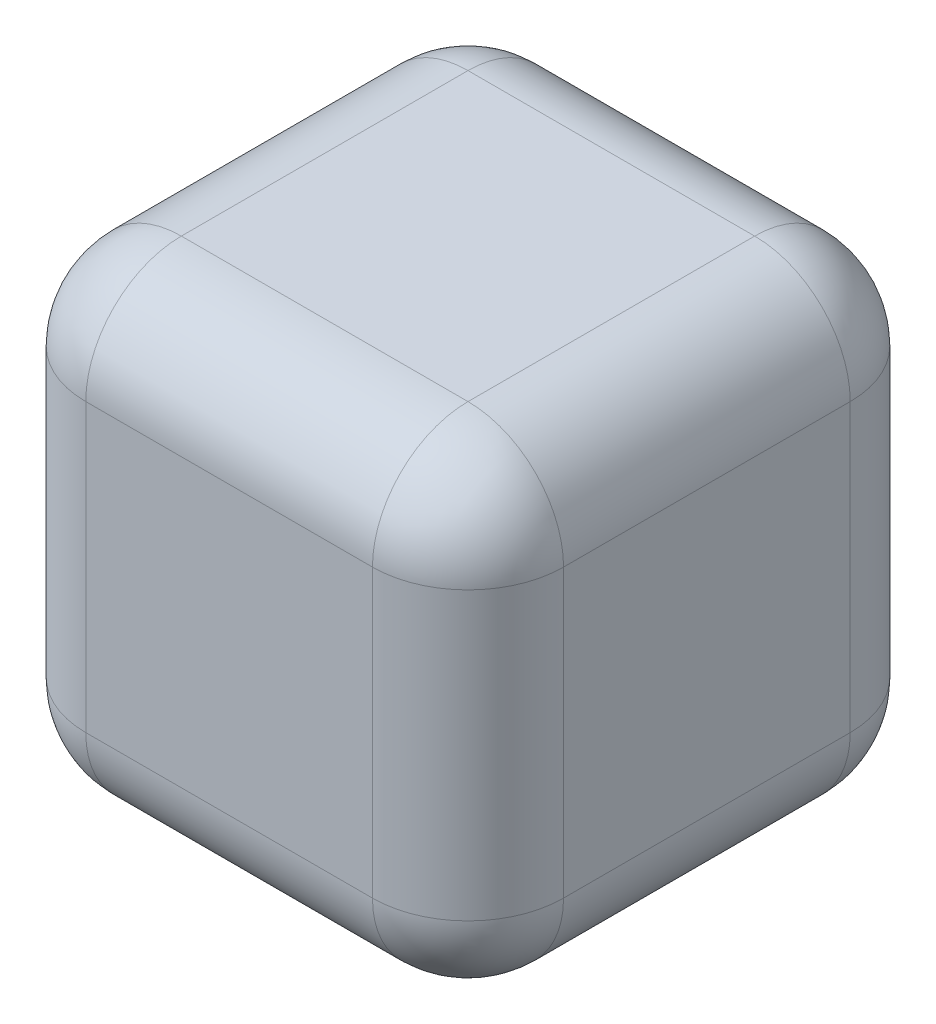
ISO-10303-21;
HEADER;
FILE_DESCRIPTION(('STEP AP214'),'2;1');
FILE_NAME('part.step','',(''),(''),'','','');
FILE_SCHEMA(('AUTOMOTIVE_DESIGN { 1 0 10303 214 1 1 1 1 }'));
ENDSEC;
DATA;
#1=APPLICATION_CONTEXT('core data for automotive mechanical design processes');
#2=APPLICATION_PROTOCOL_DEFINITION('international standard','automotive_design',2000,#1);
#3=PRODUCT_CONTEXT('',#1,'mechanical');
#4=PRODUCT('Part','Part','',(#3));
#5=PRODUCT_RELATED_PRODUCT_CATEGORY('part','',(#4));
#6=PRODUCT_DEFINITION_FORMATION('','',#4);
#7=PRODUCT_DEFINITION_CONTEXT('part definition',#1,'design');
#8=PRODUCT_DEFINITION('design','',#6,#7);
#9=PRODUCT_DEFINITION_SHAPE('','',#8);
#10=(LENGTH_UNIT() NAMED_UNIT(*) SI_UNIT(.MILLI.,.METRE.));
#11=(NAMED_UNIT(*) PLANE_ANGLE_UNIT() SI_UNIT($,.RADIAN.));
#12=(NAMED_UNIT(*) SI_UNIT($,.STERADIAN.) SOLID_ANGLE_UNIT());
#13=UNCERTAINTY_MEASURE_WITH_UNIT(LENGTH_MEASURE(1.E-05),#10,'distance_accuracy_value','');
#14=(GEOMETRIC_REPRESENTATION_CONTEXT(3) GLOBAL_UNCERTAINTY_ASSIGNED_CONTEXT((#13)) GLOBAL_UNIT_ASSIGNED_CONTEXT((#10,
#11,#12)) REPRESENTATION_CONTEXT('',''));
#15=CARTESIAN_POINT('',(0.,0.,0.));
#16=DIRECTION('',(0.,0.,1.));
#17=DIRECTION('',(1.,0.,0.));
#18=AXIS2_PLACEMENT_3D('',#15,#16,#17);
#19=CARTESIAN_POINT('',(0.,0.,10.));
#20=DIRECTION('',(1.,0.,0.));
#21=DIRECTION('',(0.,0.,-1.));
#22=AXIS2_PLACEMENT_3D('',#19,#20,#21);
#23=PLANE('',#22);
#24=DIRECTION('',(0.,-1.,0.));
#25=VECTOR('',#24,1.);
#26=CARTESIAN_POINT('',(0.,0.,8.));
#27=LINE('',#26,#25);
#28=CARTESIAN_POINT('',(0.,2.,8.));
#29=VERTEX_POINT('',#28);
#30=CARTESIAN_POINT('',(0.,8.,8.));
#31=VERTEX_POINT('',#30);
#32=EDGE_CURVE('E152',#29,#31,#27,.F.);
#33=ORIENTED_EDGE('',*,*,#32,.T.);
#34=DIRECTION('',(0.,0.,-1.));
#35=VECTOR('',#34,1.);
#36=CARTESIAN_POINT('',(0.,8.,10.));
#37=LINE('',#36,#35);
#38=CARTESIAN_POINT('',(0.,8.,2.));
#39=VERTEX_POINT('',#38);
#40=EDGE_CURVE('E155',#31,#39,#37,.T.);
#41=ORIENTED_EDGE('',*,*,#40,.T.);
#42=DIRECTION('',(0.,-1.,0.));
#43=VECTOR('',#42,1.);
#44=CARTESIAN_POINT('',(0.,0.,2.));
#45=LINE('',#44,#43);
#46=CARTESIAN_POINT('',(0.,2.,2.));
#47=VERTEX_POINT('',#46);
#48=EDGE_CURVE('E129',#39,#47,#45,.T.);
#49=ORIENTED_EDGE('',*,*,#48,.T.);
#50=DIRECTION('',(0.,0.,-1.));
#51=VECTOR('',#50,1.);
#52=CARTESIAN_POINT('',(0.,2.,10.));
#53=LINE('',#52,#51);
#54=EDGE_CURVE('E147',#47,#29,#53,.F.);
#55=ORIENTED_EDGE('',*,*,#54,.T.);
#56=EDGE_LOOP('',(#33,#41,#49,#55));
#57=FACE_BOUND('',#56,.T.);
#58=ADVANCED_FACE('F32',(#57),#23,.F.);
#59=CARTESIAN_POINT('',(0.,0.,10.));
#60=DIRECTION('',(0.,1.,0.));
#61=DIRECTION('',(0.,0.,1.));
#62=AXIS2_PLACEMENT_3D('',#59,#60,#61);
#63=PLANE('',#62);
#64=DIRECTION('',(1.,0.,0.));
#65=VECTOR('',#64,1.);
#66=CARTESIAN_POINT('',(10.,0.,2.));
#67=LINE('',#66,#65);
#68=CARTESIAN_POINT('',(2.,0.,2.));
#69=VERTEX_POINT('',#68);
#70=CARTESIAN_POINT('',(8.,0.,2.));
#71=VERTEX_POINT('',#70);
#72=EDGE_CURVE('E172',#69,#71,#67,.T.);
#73=ORIENTED_EDGE('',*,*,#72,.T.);
#74=DIRECTION('',(0.,0.,-1.));
#75=VECTOR('',#74,1.);
#76=CARTESIAN_POINT('',(8.,0.,10.));
#77=LINE('',#76,#75);
#78=CARTESIAN_POINT('',(8.,0.,8.));
#79=VERTEX_POINT('',#78);
#80=EDGE_CURVE('E175',#71,#79,#77,.F.);
#81=ORIENTED_EDGE('',*,*,#80,.T.);
#82=DIRECTION('',(1.,0.,0.));
#83=VECTOR('',#82,1.);
#84=CARTESIAN_POINT('',(0.,0.,8.));
#85=LINE('',#84,#83);
#86=CARTESIAN_POINT('',(2.,0.,8.));
#87=VERTEX_POINT('',#86);
#88=EDGE_CURVE('E170',#79,#87,#85,.F.);
#89=ORIENTED_EDGE('',*,*,#88,.T.);
#90=DIRECTION('',(0.,0.,-1.));
#91=VECTOR('',#90,1.);
#92=CARTESIAN_POINT('',(2.,0.,10.));
#93=LINE('',#92,#91);
#94=EDGE_CURVE('E168',#87,#69,#93,.T.);
#95=ORIENTED_EDGE('',*,*,#94,.T.);
#96=EDGE_LOOP('',(#73,#81,#89,#95));
#97=FACE_BOUND('',#96,.T.);
#98=ADVANCED_FACE('F322',(#97),#63,.F.);
#99=CARTESIAN_POINT('',(10.,0.,10.));
#100=DIRECTION('',(-1.,0.,0.));
#101=DIRECTION('',(0.,0.,1.));
#102=AXIS2_PLACEMENT_3D('',#99,#100,#101);
#103=PLANE('',#102);
#104=DIRECTION('',(0.,1.,0.));
#105=VECTOR('',#104,1.);
#106=CARTESIAN_POINT('',(10.,0.,8.));
#107=LINE('',#106,#105);
#108=CARTESIAN_POINT('',(10.,8.,8.));
#109=VERTEX_POINT('',#108);
#110=CARTESIAN_POINT('',(10.,2.,8.));
#111=VERTEX_POINT('',#110);
#112=EDGE_CURVE('E179',#109,#111,#107,.F.);
#113=ORIENTED_EDGE('',*,*,#112,.T.);
#114=DIRECTION('',(0.,0.,-1.));
#115=VECTOR('',#114,1.);
#116=CARTESIAN_POINT('',(10.,2.,10.));
#117=LINE('',#116,#115);
#118=CARTESIAN_POINT('',(10.,2.,2.));
#119=VERTEX_POINT('',#118);
#120=EDGE_CURVE('E184',#111,#119,#117,.T.);
#121=ORIENTED_EDGE('',*,*,#120,.T.);
#122=DIRECTION('',(0.,1.,0.));
#123=VECTOR('',#122,1.);
#124=CARTESIAN_POINT('',(10.,10.,2.));
#125=LINE('',#124,#123);
#126=CARTESIAN_POINT('',(10.,8.,2.));
#127=VERTEX_POINT('',#126);
#128=EDGE_CURVE('E181',#119,#127,#125,.T.);
#129=ORIENTED_EDGE('',*,*,#128,.T.);
#130=DIRECTION('',(0.,0.,-1.));
#131=VECTOR('',#130,1.);
#132=CARTESIAN_POINT('',(10.,8.,10.));
#133=LINE('',#132,#131);
#134=EDGE_CURVE('E177',#127,#109,#133,.F.);
#135=ORIENTED_EDGE('',*,*,#134,.T.);
#136=EDGE_LOOP('',(#113,#121,#129,#135));
#137=FACE_BOUND('',#136,.T.);
#138=ADVANCED_FACE('F292',(#137),#103,.F.);
#139=CARTESIAN_POINT('',(0.,10.,10.));
#140=DIRECTION('',(0.,-1.,0.));
#141=DIRECTION('',(0.,0.,-1.));
#142=AXIS2_PLACEMENT_3D('',#139,#140,#141);
#143=PLANE('',#142);
#144=DIRECTION('',(-1.,0.,0.));
#145=VECTOR('',#144,1.);
#146=CARTESIAN_POINT('',(0.,10.,2.));
#147=LINE('',#146,#145);
#148=CARTESIAN_POINT('',(8.,10.,2.));
#149=VERTEX_POINT('',#148);
#150=CARTESIAN_POINT('',(2.,10.,2.));
#151=VERTEX_POINT('',#150);
#152=EDGE_CURVE('E190',#149,#151,#147,.T.);
#153=ORIENTED_EDGE('',*,*,#152,.T.);
#154=DIRECTION('',(0.,0.,-1.));
#155=VECTOR('',#154,1.);
#156=CARTESIAN_POINT('',(2.,10.,10.));
#157=LINE('',#156,#155);
#158=CARTESIAN_POINT('',(2.,10.,8.));
#159=VERTEX_POINT('',#158);
#160=EDGE_CURVE('E193',#151,#159,#157,.F.);
#161=ORIENTED_EDGE('',*,*,#160,.T.);
#162=DIRECTION('',(-1.,0.,0.));
#163=VECTOR('',#162,1.);
#164=CARTESIAN_POINT('',(0.,10.,8.));
#165=LINE('',#164,#163);
#166=CARTESIAN_POINT('',(8.,10.,8.));
#167=VERTEX_POINT('',#166);
#168=EDGE_CURVE('E188',#159,#167,#165,.F.);
#169=ORIENTED_EDGE('',*,*,#168,.T.);
#170=DIRECTION('',(0.,0.,-1.));
#171=VECTOR('',#170,1.);
#172=CARTESIAN_POINT('',(8.,10.,10.));
#173=LINE('',#172,#171);
#174=EDGE_CURVE('E186',#167,#149,#173,.T.);
#175=ORIENTED_EDGE('',*,*,#174,.T.);
#176=EDGE_LOOP('',(#153,#161,#169,#175));
#177=FACE_BOUND('',#176,.T.);
#178=ADVANCED_FACE('F268',(#177),#143,.F.);
#179=CARTESIAN_POINT('',(0.,0.,10.));
#180=DIRECTION('',(0.,0.,-1.));
#181=DIRECTION('',(-1.,0.,0.));
#182=AXIS2_PLACEMENT_3D('',#179,#180,#181);
#183=PLANE('',#182);
#184=DIRECTION('',(-1.,0.,0.));
#185=VECTOR('',#184,1.);
#186=CARTESIAN_POINT('',(0.,8.,10.));
#187=LINE('',#186,#185);
#188=CARTESIAN_POINT('',(8.,8.,10.));
#189=VERTEX_POINT('',#188);
#190=CARTESIAN_POINT('',(2.,8.,10.));
#191=VERTEX_POINT('',#190);
#192=EDGE_CURVE('E195',#189,#191,#187,.T.);
#193=ORIENTED_EDGE('',*,*,#192,.T.);
#194=DIRECTION('',(0.,-1.,0.));
#195=VECTOR('',#194,1.);
#196=CARTESIAN_POINT('',(2.,0.,10.));
#197=LINE('',#196,#195);
#198=CARTESIAN_POINT('',(2.,2.,10.));
#199=VERTEX_POINT('',#198);
#200=EDGE_CURVE('E11',#191,#199,#197,.T.);
#201=ORIENTED_EDGE('',*,*,#200,.T.);
#202=DIRECTION('',(1.,0.,0.));
#203=VECTOR('',#202,1.);
#204=CARTESIAN_POINT('',(0.,2.,10.));
#205=LINE('',#204,#203);
#206=CARTESIAN_POINT('',(8.,2.,10.));
#207=VERTEX_POINT('',#206);
#208=EDGE_CURVE('E41',#199,#207,#205,.T.);
#209=ORIENTED_EDGE('',*,*,#208,.T.);
#210=DIRECTION('',(0.,1.,0.));
#211=VECTOR('',#210,1.);
#212=CARTESIAN_POINT('',(8.,0.,10.));
#213=LINE('',#212,#211);
#214=EDGE_CURVE('E197',#207,#189,#213,.T.);
#215=ORIENTED_EDGE('',*,*,#214,.T.);
#216=EDGE_LOOP('',(#193,#201,#209,#215));
#217=FACE_BOUND('',#216,.T.);
#218=ADVANCED_FACE('F276',(#217),#183,.F.);
#219=CARTESIAN_POINT('',(0.,0.,0.));
#220=DIRECTION('',(0.,0.,-1.));
#221=DIRECTION('',(-1.,0.,0.));
#222=AXIS2_PLACEMENT_3D('',#219,#220,#221);
#223=PLANE('',#222);
#224=DIRECTION('',(1.,0.,0.));
#225=VECTOR('',#224,1.);
#226=CARTESIAN_POINT('',(0.,2.,0.));
#227=LINE('',#226,#225);
#228=CARTESIAN_POINT('',(8.,2.,0.));
#229=VERTEX_POINT('',#228);
#230=CARTESIAN_POINT('',(2.,2.,0.));
#231=VERTEX_POINT('',#230);
#232=EDGE_CURVE('E165',#229,#231,#227,.F.);
#233=ORIENTED_EDGE('',*,*,#232,.T.);
#234=DIRECTION('',(0.,-1.,0.));
#235=VECTOR('',#234,1.);
#236=CARTESIAN_POINT('',(2.,10.,0.));
#237=LINE('',#236,#235);
#238=CARTESIAN_POINT('',(2.,8.,0.));
#239=VERTEX_POINT('',#238);
#240=EDGE_CURVE('E131',#231,#239,#237,.F.);
#241=ORIENTED_EDGE('',*,*,#240,.T.);
#242=DIRECTION('',(-1.,0.,0.));
#243=VECTOR('',#242,1.);
#244=CARTESIAN_POINT('',(10.,8.,0.));
#245=LINE('',#244,#243);
#246=CARTESIAN_POINT('',(8.,8.,0.));
#247=VERTEX_POINT('',#246);
#248=EDGE_CURVE('E158',#239,#247,#245,.F.);
#249=ORIENTED_EDGE('',*,*,#248,.T.);
#250=DIRECTION('',(0.,1.,0.));
#251=VECTOR('',#250,1.);
#252=CARTESIAN_POINT('',(8.,0.,0.));
#253=LINE('',#252,#251);
#254=EDGE_CURVE('E163',#247,#229,#253,.F.);
#255=ORIENTED_EDGE('',*,*,#254,.T.);
#256=EDGE_LOOP('',(#233,#241,#249,#255));
#257=FACE_BOUND('',#256,.T.);
#258=ADVANCED_FACE('F355',(#257),#223,.T.);
#259=CARTESIAN_POINT('',(8.,0.,8.));
#260=DIRECTION('',(0.,1.,0.));
#261=DIRECTION('',(0.,0.,1.));
#262=AXIS2_PLACEMENT_3D('',#259,#260,#261);
#263=CYLINDRICAL_SURFACE('',#262,2.);
#264=CARTESIAN_POINT('',(8.,8.,8.));
#265=DIRECTION('',(0.,1.,0.));
#266=DIRECTION('',(0.,0.,1.));
#267=AXIS2_PLACEMENT_3D('',#264,#265,#266);
#268=CIRCLE('',#267,2.);
#269=EDGE_CURVE('E36',#189,#109,#268,.T.);
#270=ORIENTED_EDGE('',*,*,#269,.F.);
#271=ORIENTED_EDGE('',*,*,#214,.F.);
#272=CARTESIAN_POINT('',(8.,2.,8.));
#273=DIRECTION('',(0.,-1.,0.));
#274=DIRECTION('',(0.,0.,-1.));
#275=AXIS2_PLACEMENT_3D('',#272,#273,#274);
#276=CIRCLE('',#275,2.);
#277=EDGE_CURVE('E246',#111,#207,#276,.T.);
#278=ORIENTED_EDGE('',*,*,#277,.F.);
#279=ORIENTED_EDGE('',*,*,#112,.F.);
#280=EDGE_LOOP('',(#270,#271,#278,#279));
#281=FACE_BOUND('',#280,.T.);
#282=ADVANCED_FACE('F34',(#281),#263,.T.);
#283=CARTESIAN_POINT('',(8.,8.,8.));
#284=DIRECTION('',(1.,0.,0.));
#285=DIRECTION('',(0.,0.,-1.));
#286=AXIS2_PLACEMENT_3D('',#283,#284,#285);
#287=SPHERICAL_SURFACE('',#286,2.);
#288=CARTESIAN_POINT('',(8.,8.,8.));
#289=DIRECTION('',(1.,0.,0.));
#290=DIRECTION('',(0.,0.,-1.));
#291=AXIS2_PLACEMENT_3D('',#288,#289,#290);
#292=CIRCLE('',#291,2.);
#293=EDGE_CURVE('E241',#189,#167,#292,.F.);
#294=ORIENTED_EDGE('',*,*,#293,.F.);
#295=ORIENTED_EDGE('',*,*,#269,.T.);
#296=CARTESIAN_POINT('',(8.,8.,8.));
#297=DIRECTION('',(0.,0.,1.));
#298=DIRECTION('',(1.,0.,0.));
#299=AXIS2_PLACEMENT_3D('',#296,#297,#298);
#300=CIRCLE('',#299,2.);
#301=EDGE_CURVE('E244',#167,#109,#300,.F.);
#302=ORIENTED_EDGE('',*,*,#301,.F.);
#303=EDGE_LOOP('',(#294,#295,#302));
#304=FACE_BOUND('',#303,.T.);
#305=ADVANCED_FACE('F257',(#304),#287,.T.);
#306=CARTESIAN_POINT('',(8.,2.,8.));
#307=DIRECTION('',(0.,0.,1.));
#308=DIRECTION('',(1.,0.,0.));
#309=AXIS2_PLACEMENT_3D('',#306,#307,#308);
#310=SPHERICAL_SURFACE('',#309,2.);
#311=CARTESIAN_POINT('',(8.,2.,8.));
#312=DIRECTION('',(0.,0.,1.));
#313=DIRECTION('',(1.,0.,0.));
#314=AXIS2_PLACEMENT_3D('',#311,#312,#313);
#315=CIRCLE('',#314,2.);
#316=EDGE_CURVE('E235',#111,#79,#315,.F.);
#317=ORIENTED_EDGE('',*,*,#316,.F.);
#318=ORIENTED_EDGE('',*,*,#277,.T.);
#319=CARTESIAN_POINT('',(8.,2.,8.));
#320=DIRECTION('',(1.,0.,0.));
#321=DIRECTION('',(0.,0.,-1.));
#322=AXIS2_PLACEMENT_3D('',#319,#320,#321);
#323=CIRCLE('',#322,2.);
#324=EDGE_CURVE('E238',#79,#207,#323,.F.);
#325=ORIENTED_EDGE('',*,*,#324,.F.);
#326=EDGE_LOOP('',(#317,#318,#325));
#327=FACE_BOUND('',#326,.T.);
#328=ADVANCED_FACE('F284',(#327),#310,.T.);
#329=CARTESIAN_POINT('',(8.,8.,10.));
#330=DIRECTION('',(0.,0.,-1.));
#331=DIRECTION('',(-1.,0.,0.));
#332=AXIS2_PLACEMENT_3D('',#329,#330,#331);
#333=CYLINDRICAL_SURFACE('',#332,2.);
#334=ORIENTED_EDGE('',*,*,#301,.T.);
#335=ORIENTED_EDGE('',*,*,#134,.F.);
#336=CARTESIAN_POINT('',(8.,8.,2.));
#337=DIRECTION('',(0.,0.,-1.));
#338=DIRECTION('',(-1.,0.,0.));
#339=AXIS2_PLACEMENT_3D('',#336,#337,#338);
#340=CIRCLE('',#339,2.);
#341=EDGE_CURVE('E230',#149,#127,#340,.T.);
#342=ORIENTED_EDGE('',*,*,#341,.F.);
#343=ORIENTED_EDGE('',*,*,#174,.F.);
#344=EDGE_LOOP('',(#334,#335,#342,#343));
#345=FACE_BOUND('',#344,.T.);
#346=ADVANCED_FACE('F264',(#345),#333,.T.);
#347=CARTESIAN_POINT('',(0.,8.,8.));
#348=DIRECTION('',(-1.,0.,0.));
#349=DIRECTION('',(0.,0.,1.));
#350=AXIS2_PLACEMENT_3D('',#347,#348,#349);
#351=CYLINDRICAL_SURFACE('',#350,2.);
#352=ORIENTED_EDGE('',*,*,#293,.T.);
#353=ORIENTED_EDGE('',*,*,#168,.F.);
#354=CARTESIAN_POINT('',(2.,8.,8.));
#355=DIRECTION('',(-1.,0.,0.));
#356=DIRECTION('',(0.,0.,1.));
#357=AXIS2_PLACEMENT_3D('',#354,#355,#356);
#358=CIRCLE('',#357,2.);
#359=EDGE_CURVE('E227',#191,#159,#358,.T.);
#360=ORIENTED_EDGE('',*,*,#359,.F.);
#361=ORIENTED_EDGE('',*,*,#192,.F.);
#362=EDGE_LOOP('',(#352,#353,#360,#361));
#363=FACE_BOUND('',#362,.T.);
#364=ADVANCED_FACE('F274',(#363),#351,.T.);
#365=CARTESIAN_POINT('',(2.,0.,8.));
#366=DIRECTION('',(0.,-1.,0.));
#367=DIRECTION('',(0.,0.,-1.));
#368=AXIS2_PLACEMENT_3D('',#365,#366,#367);
#369=CYLINDRICAL_SURFACE('',#368,2.);
#370=CARTESIAN_POINT('',(2.,2.,8.));
#371=DIRECTION('',(0.,-1.,0.));
#372=DIRECTION('',(0.,0.,-1.));
#373=AXIS2_PLACEMENT_3D('',#370,#371,#372);
#374=CIRCLE('',#373,2.);
#375=EDGE_CURVE('E222',#199,#29,#374,.T.);
#376=ORIENTED_EDGE('',*,*,#375,.F.);
#377=ORIENTED_EDGE('',*,*,#200,.F.);
#378=CARTESIAN_POINT('',(2.,8.,8.));
#379=DIRECTION('',(0.,1.,0.));
#380=DIRECTION('',(0.,0.,1.));
#381=AXIS2_PLACEMENT_3D('',#378,#379,#380);
#382=CIRCLE('',#381,2.);
#383=EDGE_CURVE('E224',#31,#191,#382,.T.);
#384=ORIENTED_EDGE('',*,*,#383,.F.);
#385=ORIENTED_EDGE('',*,*,#32,.F.);
#386=EDGE_LOOP('',(#376,#377,#384,#385));
#387=FACE_BOUND('',#386,.T.);
#388=ADVANCED_FACE('F279',(#387),#369,.T.);
#389=CARTESIAN_POINT('',(0.,2.,8.));
#390=DIRECTION('',(1.,0.,0.));
#391=DIRECTION('',(0.,0.,-1.));
#392=AXIS2_PLACEMENT_3D('',#389,#390,#391);
#393=CYLINDRICAL_SURFACE('',#392,2.);
#394=ORIENTED_EDGE('',*,*,#324,.T.);
#395=ORIENTED_EDGE('',*,*,#208,.F.);
#396=CARTESIAN_POINT('',(2.,2.,8.));
#397=DIRECTION('',(-1.,0.,0.));
#398=DIRECTION('',(0.,0.,1.));
#399=AXIS2_PLACEMENT_3D('',#396,#397,#398);
#400=CIRCLE('',#399,2.);
#401=EDGE_CURVE('E49',#87,#199,#400,.T.);
#402=ORIENTED_EDGE('',*,*,#401,.F.);
#403=ORIENTED_EDGE('',*,*,#88,.F.);
#404=EDGE_LOOP('',(#394,#395,#402,#403));
#405=FACE_BOUND('',#404,.T.);
#406=ADVANCED_FACE('F282',(#405),#393,.T.);
#407=CARTESIAN_POINT('',(8.,2.,10.));
#408=DIRECTION('',(0.,0.,-1.));
#409=DIRECTION('',(-1.,0.,0.));
#410=AXIS2_PLACEMENT_3D('',#407,#408,#409);
#411=CYLINDRICAL_SURFACE('',#410,2.);
#412=ORIENTED_EDGE('',*,*,#316,.T.);
#413=ORIENTED_EDGE('',*,*,#80,.F.);
#414=CARTESIAN_POINT('',(8.,2.,2.));
#415=DIRECTION('',(0.,0.,-1.));
#416=DIRECTION('',(-1.,0.,0.));
#417=AXIS2_PLACEMENT_3D('',#414,#415,#416);
#418=CIRCLE('',#417,2.);
#419=EDGE_CURVE('E218',#119,#71,#418,.T.);
#420=ORIENTED_EDGE('',*,*,#419,.F.);
#421=ORIENTED_EDGE('',*,*,#120,.F.);
#422=EDGE_LOOP('',(#412,#413,#420,#421));
#423=FACE_BOUND('',#422,.T.);
#424=ADVANCED_FACE('F289',(#423),#411,.T.);
#425=CARTESIAN_POINT('',(8.,0.,2.));
#426=DIRECTION('',(0.,-1.,0.));
#427=DIRECTION('',(0.,0.,-1.));
#428=AXIS2_PLACEMENT_3D('',#425,#426,#427);
#429=CYLINDRICAL_SURFACE('',#428,2.);
#430=CARTESIAN_POINT('',(8.,8.,2.));
#431=DIRECTION('',(0.,1.,0.));
#432=DIRECTION('',(0.,0.,1.));
#433=AXIS2_PLACEMENT_3D('',#430,#431,#432);
#434=CIRCLE('',#433,2.);
#435=EDGE_CURVE('E232',#127,#247,#434,.T.);
#436=ORIENTED_EDGE('',*,*,#435,.F.);
#437=ORIENTED_EDGE('',*,*,#128,.F.);
#438=CARTESIAN_POINT('',(8.,2.,2.));
#439=DIRECTION('',(0.,-1.,0.));
#440=DIRECTION('',(0.,0.,-1.));
#441=AXIS2_PLACEMENT_3D('',#438,#439,#440);
#442=CIRCLE('',#441,2.);
#443=EDGE_CURVE('E215',#229,#119,#442,.T.);
#444=ORIENTED_EDGE('',*,*,#443,.F.);
#445=ORIENTED_EDGE('',*,*,#254,.F.);
#446=EDGE_LOOP('',(#436,#437,#444,#445));
#447=FACE_BOUND('',#446,.T.);
#448=ADVANCED_FACE('F296',(#447),#429,.T.);
#449=CARTESIAN_POINT('',(8.,8.,2.));
#450=DIRECTION('',(1.,0.,0.));
#451=DIRECTION('',(0.,0.,-1.));
#452=AXIS2_PLACEMENT_3D('',#449,#450,#451);
#453=SPHERICAL_SURFACE('',#452,2.);
#454=ORIENTED_EDGE('',*,*,#341,.T.);
#455=ORIENTED_EDGE('',*,*,#435,.T.);
#456=CARTESIAN_POINT('',(8.,8.,2.));
#457=DIRECTION('',(1.,0.,0.));
#458=DIRECTION('',(0.,0.,-1.));
#459=AXIS2_PLACEMENT_3D('',#456,#457,#458);
#460=CIRCLE('',#459,2.);
#461=EDGE_CURVE('E212',#149,#247,#460,.F.);
#462=ORIENTED_EDGE('',*,*,#461,.F.);
#463=EDGE_LOOP('',(#454,#455,#462));
#464=FACE_BOUND('',#463,.T.);
#465=ADVANCED_FACE('F300',(#464),#453,.T.);
#466=CARTESIAN_POINT('',(2.,8.,8.));
#467=DIRECTION('',(0.,0.,1.));
#468=DIRECTION('',(1.,0.,0.));
#469=AXIS2_PLACEMENT_3D('',#466,#467,#468);
#470=SPHERICAL_SURFACE('',#469,2.);
#471=ORIENTED_EDGE('',*,*,#383,.T.);
#472=ORIENTED_EDGE('',*,*,#359,.T.);
#473=CARTESIAN_POINT('',(2.,8.,8.));
#474=DIRECTION('',(0.,0.,1.));
#475=DIRECTION('',(1.,0.,0.));
#476=AXIS2_PLACEMENT_3D('',#473,#474,#475);
#477=CIRCLE('',#476,2.);
#478=EDGE_CURVE('E209',#31,#159,#477,.F.);
#479=ORIENTED_EDGE('',*,*,#478,.F.);
#480=EDGE_LOOP('',(#471,#472,#479));
#481=FACE_BOUND('',#480,.T.);
#482=ADVANCED_FACE('F310',(#481),#470,.T.);
#483=CARTESIAN_POINT('',(2.,2.,8.));
#484=DIRECTION('',(0.,0.,1.));
#485=DIRECTION('',(1.,0.,0.));
#486=AXIS2_PLACEMENT_3D('',#483,#484,#485);
#487=SPHERICAL_SURFACE('',#486,2.);
#488=ORIENTED_EDGE('',*,*,#401,.T.);
#489=ORIENTED_EDGE('',*,*,#375,.T.);
#490=CARTESIAN_POINT('',(2.,2.,8.));
#491=DIRECTION('',(0.,0.,1.));
#492=DIRECTION('',(1.,0.,0.));
#493=AXIS2_PLACEMENT_3D('',#490,#491,#492);
#494=CIRCLE('',#493,2.);
#495=EDGE_CURVE('E149',#87,#29,#494,.F.);
#496=ORIENTED_EDGE('',*,*,#495,.F.);
#497=EDGE_LOOP('',(#488,#489,#496));
#498=FACE_BOUND('',#497,.T.);
#499=ADVANCED_FACE('F312',(#498),#487,.T.);
#500=CARTESIAN_POINT('',(8.,2.,2.));
#501=DIRECTION('',(1.,0.,0.));
#502=DIRECTION('',(0.,0.,-1.));
#503=AXIS2_PLACEMENT_3D('',#500,#501,#502);
#504=SPHERICAL_SURFACE('',#503,2.);
#505=ORIENTED_EDGE('',*,*,#443,.T.);
#506=ORIENTED_EDGE('',*,*,#419,.T.);
#507=CARTESIAN_POINT('',(8.,2.,2.));
#508=DIRECTION('',(1.,0.,0.));
#509=DIRECTION('',(0.,0.,-1.));
#510=AXIS2_PLACEMENT_3D('',#507,#508,#509);
#511=CIRCLE('',#510,2.);
#512=EDGE_CURVE('E206',#229,#71,#511,.F.);
#513=ORIENTED_EDGE('',*,*,#512,.F.);
#514=EDGE_LOOP('',(#505,#506,#513));
#515=FACE_BOUND('',#514,.T.);
#516=ADVANCED_FACE('F318',(#515),#504,.T.);
#517=CARTESIAN_POINT('',(0.,8.,2.));
#518=DIRECTION('',(1.,0.,0.));
#519=DIRECTION('',(0.,0.,-1.));
#520=AXIS2_PLACEMENT_3D('',#517,#518,#519);
#521=CYLINDRICAL_SURFACE('',#520,2.);
#522=ORIENTED_EDGE('',*,*,#461,.T.);
#523=ORIENTED_EDGE('',*,*,#248,.F.);
#524=CARTESIAN_POINT('',(2.,8.,2.));
#525=DIRECTION('',(-1.,0.,0.));
#526=DIRECTION('',(0.,0.,1.));
#527=AXIS2_PLACEMENT_3D('',#524,#525,#526);
#528=CIRCLE('',#527,2.);
#529=EDGE_CURVE('E203',#151,#239,#528,.T.);
#530=ORIENTED_EDGE('',*,*,#529,.F.);
#531=ORIENTED_EDGE('',*,*,#152,.F.);
#532=EDGE_LOOP('',(#522,#523,#530,#531));
#533=FACE_BOUND('',#532,.T.);
#534=ADVANCED_FACE('F303',(#533),#521,.T.);
#535=CARTESIAN_POINT('',(2.,8.,10.));
#536=DIRECTION('',(0.,0.,-1.));
#537=DIRECTION('',(-1.,0.,0.));
#538=AXIS2_PLACEMENT_3D('',#535,#536,#537);
#539=CYLINDRICAL_SURFACE('',#538,2.);
#540=ORIENTED_EDGE('',*,*,#478,.T.);
#541=ORIENTED_EDGE('',*,*,#160,.F.);
#542=CARTESIAN_POINT('',(2.,8.,2.));
#543=DIRECTION('',(0.,0.,-1.));
#544=DIRECTION('',(-1.,0.,0.));
#545=AXIS2_PLACEMENT_3D('',#542,#543,#544);
#546=CIRCLE('',#545,2.);
#547=EDGE_CURVE('E144',#39,#151,#546,.T.);
#548=ORIENTED_EDGE('',*,*,#547,.F.);
#549=ORIENTED_EDGE('',*,*,#40,.F.);
#550=EDGE_LOOP('',(#540,#541,#548,#549));
#551=FACE_BOUND('',#550,.T.);
#552=ADVANCED_FACE('F308',(#551),#539,.T.);
#553=CARTESIAN_POINT('',(2.,2.,10.));
#554=DIRECTION('',(0.,0.,-1.));
#555=DIRECTION('',(-1.,0.,0.));
#556=AXIS2_PLACEMENT_3D('',#553,#554,#555);
#557=CYLINDRICAL_SURFACE('',#556,2.);
#558=ORIENTED_EDGE('',*,*,#495,.T.);
#559=ORIENTED_EDGE('',*,*,#54,.F.);
#560=CARTESIAN_POINT('',(2.,2.,2.));
#561=DIRECTION('',(0.,0.,-1.));
#562=DIRECTION('',(-1.,0.,0.));
#563=AXIS2_PLACEMENT_3D('',#560,#561,#562);
#564=CIRCLE('',#563,2.);
#565=EDGE_CURVE('E137',#69,#47,#564,.T.);
#566=ORIENTED_EDGE('',*,*,#565,.F.);
#567=ORIENTED_EDGE('',*,*,#94,.F.);
#568=EDGE_LOOP('',(#558,#559,#566,#567));
#569=FACE_BOUND('',#568,.T.);
#570=ADVANCED_FACE('F148',(#569),#557,.T.);
#571=CARTESIAN_POINT('',(0.,2.,2.));
#572=DIRECTION('',(-1.,0.,0.));
#573=DIRECTION('',(0.,0.,1.));
#574=AXIS2_PLACEMENT_3D('',#571,#572,#573);
#575=CYLINDRICAL_SURFACE('',#574,2.);
#576=ORIENTED_EDGE('',*,*,#512,.T.);
#577=ORIENTED_EDGE('',*,*,#72,.F.);
#578=CARTESIAN_POINT('',(2.,2.,2.));
#579=DIRECTION('',(-1.,0.,0.));
#580=DIRECTION('',(0.,0.,1.));
#581=AXIS2_PLACEMENT_3D('',#578,#579,#580);
#582=CIRCLE('',#581,2.);
#583=EDGE_CURVE('E141',#231,#69,#582,.T.);
#584=ORIENTED_EDGE('',*,*,#583,.F.);
#585=ORIENTED_EDGE('',*,*,#232,.F.);
#586=EDGE_LOOP('',(#576,#577,#584,#585));
#587=FACE_BOUND('',#586,.T.);
#588=ADVANCED_FACE('F338',(#587),#575,.T.);
#589=CARTESIAN_POINT('',(2.,8.,2.));
#590=DIRECTION('',(0.,1.,0.));
#591=DIRECTION('',(0.,0.,1.));
#592=AXIS2_PLACEMENT_3D('',#589,#590,#591);
#593=SPHERICAL_SURFACE('',#592,2.);
#594=ORIENTED_EDGE('',*,*,#547,.T.);
#595=ORIENTED_EDGE('',*,*,#529,.T.);
#596=CARTESIAN_POINT('',(2.,8.,2.));
#597=DIRECTION('',(0.,1.,0.));
#598=DIRECTION('',(0.,0.,1.));
#599=AXIS2_PLACEMENT_3D('',#596,#597,#598);
#600=CIRCLE('',#599,2.);
#601=EDGE_CURVE('E134',#39,#239,#600,.F.);
#602=ORIENTED_EDGE('',*,*,#601,.F.);
#603=EDGE_LOOP('',(#594,#595,#602));
#604=FACE_BOUND('',#603,.T.);
#605=ADVANCED_FACE('F335',(#604),#593,.T.);
#606=CARTESIAN_POINT('',(2.,2.,2.));
#607=DIRECTION('',(0.,-1.,0.));
#608=DIRECTION('',(0.,0.,-1.));
#609=AXIS2_PLACEMENT_3D('',#606,#607,#608);
#610=SPHERICAL_SURFACE('',#609,2.);
#611=ORIENTED_EDGE('',*,*,#583,.T.);
#612=ORIENTED_EDGE('',*,*,#565,.T.);
#613=CARTESIAN_POINT('',(2.,2.,2.));
#614=DIRECTION('',(0.,-1.,0.));
#615=DIRECTION('',(0.,0.,-1.));
#616=AXIS2_PLACEMENT_3D('',#613,#614,#615);
#617=CIRCLE('',#616,2.);
#618=EDGE_CURVE('E125',#231,#47,#617,.F.);
#619=ORIENTED_EDGE('',*,*,#618,.F.);
#620=EDGE_LOOP('',(#611,#612,#619));
#621=FACE_BOUND('',#620,.T.);
#622=ADVANCED_FACE('F139',(#621),#610,.T.);
#623=CARTESIAN_POINT('',(2.,0.,2.));
#624=DIRECTION('',(0.,1.,0.));
#625=DIRECTION('',(0.,0.,1.));
#626=AXIS2_PLACEMENT_3D('',#623,#624,#625);
#627=CYLINDRICAL_SURFACE('',#626,2.);
#628=ORIENTED_EDGE('',*,*,#601,.T.);
#629=ORIENTED_EDGE('',*,*,#240,.F.);
#630=ORIENTED_EDGE('',*,*,#618,.T.);
#631=ORIENTED_EDGE('',*,*,#48,.F.);
#632=EDGE_LOOP('',(#628,#629,#630,#631));
#633=FACE_BOUND('',#632,.T.);
#634=ADVANCED_FACE('F127',(#633),#627,.T.);
#635=CLOSED_SHELL('',(#58,#98,#138,#178,#218,#258,#282,#305,#328,#346,#364,#388,#406,#424,#448,
#465,#482,#499,#516,#534,#552,#570,#588,#605,#622,#634));
#636=MANIFOLD_SOLID_BREP('B2',#635);
#637=ADVANCED_BREP_SHAPE_REPRESENTATION('',(#18,#636),#14);
#638=SHAPE_DEFINITION_REPRESENTATION(#9,#637);
ENDSEC;
END-ISO-10303-21;
